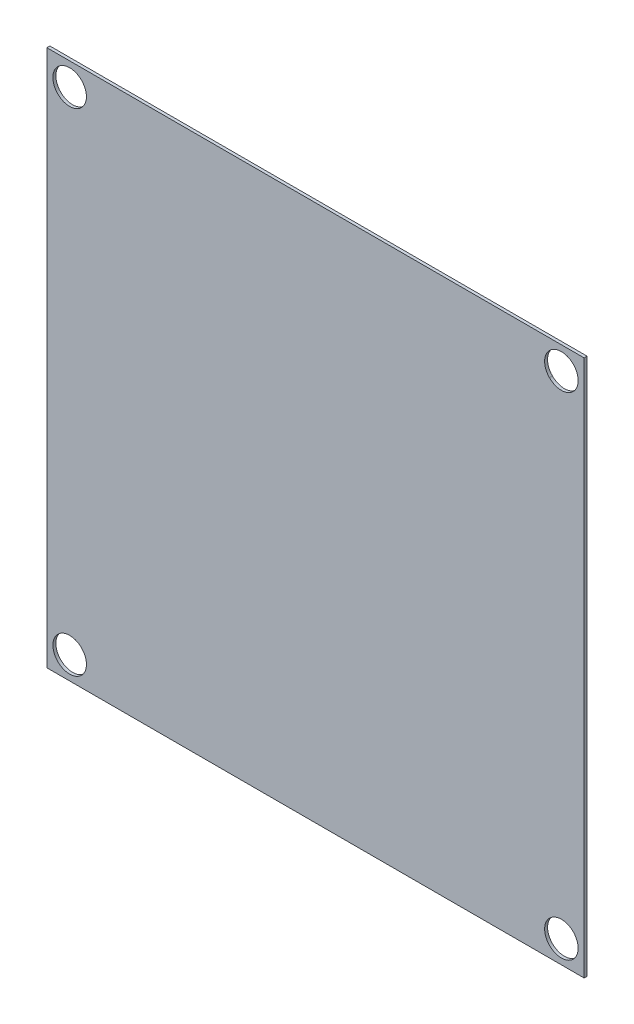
from build123d import *

# Parameters (mm, degrees)
SKETCH2_W           = 284.833113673
SKETCH2_H           = 284.76
SKETCH2_R           = 9.568159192
BOSS_EXTRUDE1_DEPTH = 1.5748
BOSS_EXTRUDE2_DEPTH = 1.5748
SKETCH4_R           = 8.89
CUT_EXTRUDE1_DEPTH  = 1.5748


with BuildPart() as part:
    # Sketch2 → Boss-Extrude1 (new body)
    with BuildSketch(Plane.XY):
        with Locations((165.560491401, 176.023367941)):
            Rectangle(SKETCH2_W, SKETCH2_H)
        with Locations(Location((296.409533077, 306.825673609, 0), (0, 0, 180))):
            Circle(SKETCH2_R, mode=Mode.SUBTRACT)
    extrude(amount=BOSS_EXTRUDE1_DEPTH)

    # Sketch3 → Boss-Extrude2 (add)
    with BuildSketch(Plane.XY.offset(1.5748)):
        with BuildLine():
            ThreePointArc((304.813411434, 306.35282518), (299.324940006, 298.139317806), (289.636425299, 300.067452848))
            Line((289.636425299, 300.067452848), (23.143934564, 33.643367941))
            Line((23.143934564, 33.643367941), (307.977048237, 33.643367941))
            Line((307.977048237, 33.643367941), (307.977048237, 318.403367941))
            Line((307.977048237, 318.403367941), (302.210397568, 312.638197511))
            ThreePointArc((302.210397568, 312.638197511), (304.136918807, 309.754353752), (304.813411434, 306.35282518))
        make_face()
        with BuildLine():
            Line((23.143934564, 33.643367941), (289.636425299, 300.067452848))
            ThreePointArc((289.636425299, 300.067452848), (289.638039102, 312.639811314), (302.210397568, 312.638197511))
            Line((302.210397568, 312.638197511), (307.977048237, 318.403367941))
            Line((307.977048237, 318.403367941), (23.143934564, 318.403367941))
            Line((23.143934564, 318.403367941), (23.143934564, 33.643367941))
        make_face()
    extrude(amount=-BOSS_EXTRUDE2_DEPTH)

    # Sketch4 → Cut-Extrude1 (cut)
    with BuildSketch(Plane.XY.offset(1.5748)):
        with Locations((35.197571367, 306.35282518)):
            Circle(SKETCH4_R)
        with Locations((35.197571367, 45.693910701)):
            Circle(SKETCH4_R)
        with Locations((295.923411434, 45.693910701)):
            Circle(SKETCH4_R)
    extrude(amount=-CUT_EXTRUDE1_DEPTH, mode=Mode.SUBTRACT)


solid = part.part
